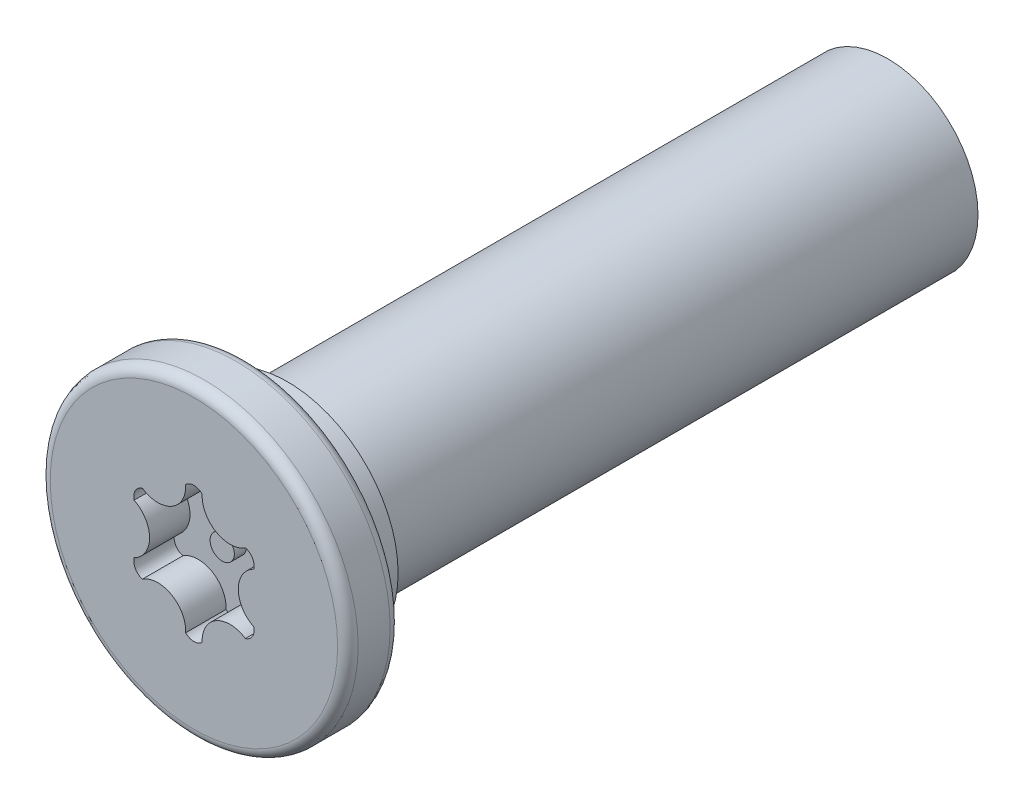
from build123d import *

# Parameters (mm, degrees)
SKETCH2_W           = 1.3
SKETCH2_H           = 3.81
SKETCH2_W_2         = 12.7
SKETCH2_H_2         = 2.23
CUT_EXTRUDE3_DEPTH  = 1
FILLET12_R          = 0.254
CUT_EXTRUDE6_START  = -12.7
SKETCH7_R           = 2.23
CUT_EXTRUDE6_DEPTH  = 12.7
SKETCH11_R          = 2.738000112
SKETCH11_R_2        = 2.230000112
BOSS_EXTRUDE1_DEPTH = 1.016
SKETCH12_R          = 2.230000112
BOSS_EXTRUDE2_DEPTH = 12.7
SKETCH14_R          = 0.3
BOSS_EXTRUDE4_DEPTH = 0.3
CUT_EXTRUDE7_START  = -12.7
SKETCH15_R          = 2.230000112
CUT_EXTRUDE7_DEPTH  = 12.7
SKETCH16_R          = 2.230000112
BOSS_EXTRUDE5_DEPTH = 15.875


with BuildPart() as part:
    # Sketch2 → Revolve1 (revolve)
    with BuildSketch(Plane(origin=(0, 0, 0), x_dir=(0, 0, -1), z_dir=(1, 0, 0)), mode=Mode.PRIVATE) as revolve1_sk:
        with Locations((0.65, 1.905)):
            Rectangle(SKETCH2_W, SKETCH2_H)
        with Locations((7.65, 1.115)):
            Rectangle(SKETCH2_W_2, SKETCH2_H_2)
    revolve(revolve1_sk.sketch.rotate(Axis((0, 0, -1.3), (0, 0, -1)), 90), axis=Axis((0, 0, -1.3), (0, 0, -1)))

    # Sketch3 → Cut-Extrude3 (cut)
    with BuildSketch(Plane.XY):
        with BuildLine():
            ThreePointArc((-0.205060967, 1.589373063), (0, 1.674312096), (0.205060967, 1.589373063))
            ThreePointArc((0.205060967, 1.589373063), (0.54882888, 0.950599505), (1.273906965, 0.972274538))
            ThreePointArc((1.273906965, 0.972274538), (1.449996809, 0.837156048), (1.478967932, 0.617098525))
            ThreePointArc((1.478967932, 0.617098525), (1.097657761, 0), (1.478967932, -0.617098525))
            ThreePointArc((1.478967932, -0.617098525), (1.449996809, -0.837156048), (1.273906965, -0.972274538))
            ThreePointArc((1.273906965, -0.972274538), (0.54882888, -0.950599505), (0.205060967, -1.589373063))
            ThreePointArc((0.205060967, -1.589373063), (0, -1.674312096), (-0.205060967, -1.589373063))
            ThreePointArc((-0.205060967, -1.589373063), (-0.54882888, -0.950599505), (-1.273906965, -0.972274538))
            ThreePointArc((-1.273906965, -0.972274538), (-1.449996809, -0.837156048), (-1.478967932, -0.617098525))
            ThreePointArc((-1.478967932, -0.617098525), (-1.097657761, 0), (-1.478967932, 0.617098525))
            ThreePointArc((-1.478967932, 0.617098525), (-1.449996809, 0.837156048), (-1.273906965, 0.972274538))
            ThreePointArc((-1.273906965, 0.972274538), (-0.54882888, 0.950599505), (-0.205060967, 1.589373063))
        make_face()
    extrude(amount=-CUT_EXTRUDE3_DEPTH, mode=Mode.SUBTRACT)

    # Fillet12
    fillet12_edges = [part.edges().sort_by_distance(p)[0] for p in [
        (-3.81, 0, 0),
        (-3.81, 0, -1.3),
    ]]
    fillet(fillet12_edges, radius=FILLET12_R)

    # Sketch7 → Cut-Extrude6 (cut)
    with BuildSketch(Plane(origin=(0, 0, -14), x_dir=(-1, 0, 0), z_dir=(0, 0, -1)).offset(CUT_EXTRUDE6_START)):
        Circle(SKETCH7_R)
    extrude(amount=CUT_EXTRUDE6_DEPTH, mode=Mode.SUBTRACT)

    # Sketch11 → Boss-Extrude1 (add)
    with BuildSketch(Plane(origin=(0, 0, -1.3), x_dir=(-1, 0, 0), z_dir=(0, 0, -1))):
        with Locations(Location((0, 0, 0), (0, 0, 180))):
            Circle(SKETCH11_R)
        Circle(SKETCH11_R_2, mode=Mode.SUBTRACT)
    extrude(amount=BOSS_EXTRUDE1_DEPTH)

    # Sketch12 → Boss-Extrude2 (add)
    with BuildSketch(Plane(origin=(0, 0, -1.3), x_dir=(-1, 0, 0), z_dir=(0, 0, -1))):
        Circle(SKETCH12_R)
    extrude(amount=BOSS_EXTRUDE2_DEPTH)

    # Sketch14 → Boss-Extrude4 (add)
    with BuildSketch(Plane.XY.offset(-1)):
        Circle(SKETCH14_R)
    extrude(amount=BOSS_EXTRUDE4_DEPTH)

    # Sketch15 → Cut-Extrude7 (cut)
    with BuildSketch(Plane(origin=(0, 0, -14), x_dir=(-1, 0, 0), z_dir=(0, 0, -1)).offset(CUT_EXTRUDE7_START)):
        Circle(SKETCH15_R)
    extrude(amount=CUT_EXTRUDE7_DEPTH, mode=Mode.SUBTRACT)

    # Sketch16 → Boss-Extrude5 (add)
    with BuildSketch(Plane(origin=(0, 0, -1.3), x_dir=(-1, 0, 0), z_dir=(0, 0, -1))):
        Circle(SKETCH16_R)
    extrude(amount=BOSS_EXTRUDE5_DEPTH)


solid = part.part
